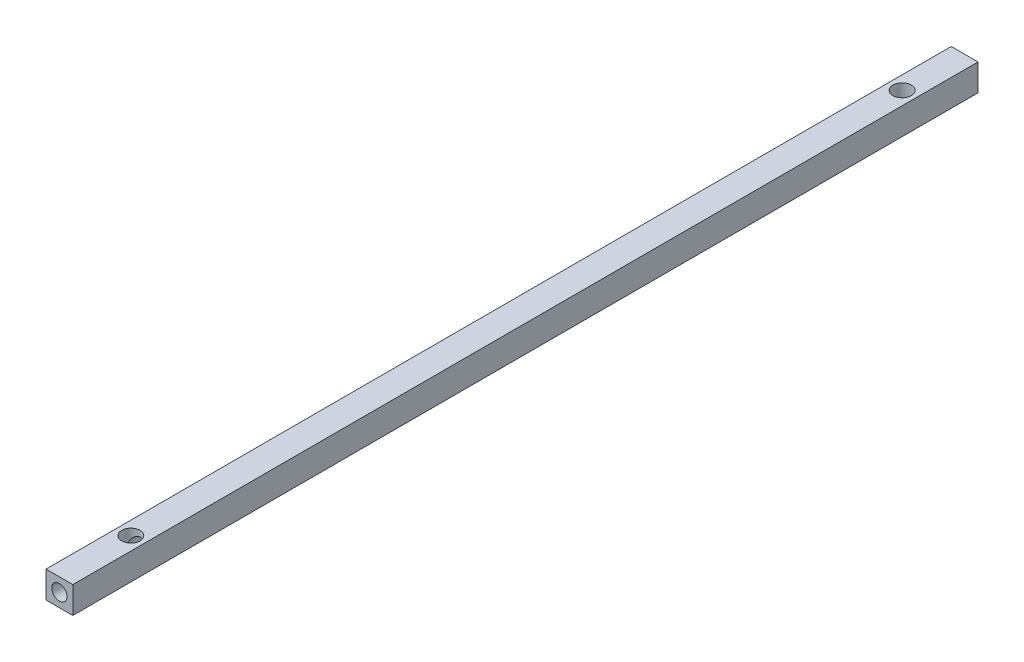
from build123d import *

# Parameters (mm, degrees)
SKETCH1_W                 = 4.7625
SKETCH1_H                 = 4.7625
EXTRUDE1_DEPTH            = 160.9725
F_6_32_TAPPED_HOLE1_D     = 2.7051
F_6_32_TAPPED_HOLE1_DEPTH = 16.764
F_6_32_TAPPED_HOLE1_TIP   = 0.81269403
F_4_CLEARANCE_HOLE1_D     = 3.2639
F_4_CLEARANCE_HOLE1_DEPTH = 10.922
F_4_CLEARANCE_HOLE1_TIP   = 0.980574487


with BuildPart() as part:
    # Sketch1 → Extrude1 (new body)
    with BuildSketch(Plane.XY):
        with Locations((2.38125, 2.38125)):
            Rectangle(SKETCH1_W, SKETCH1_H)
    extrude(amount=EXTRUDE1_DEPTH)

    # 6-32 Tapped Hole1
    with Locations(Plane.XY.offset(160.9725)):
        with Locations((2.38125, 2.38125)):
            Hole(F_6_32_TAPPED_HOLE1_D / 2, depth=F_6_32_TAPPED_HOLE1_DEPTH)
            with Locations((0, 0, -(F_6_32_TAPPED_HOLE1_DEPTH + F_6_32_TAPPED_HOLE1_TIP / 2))):  # 118° drill point
                Cone(0, F_6_32_TAPPED_HOLE1_D / 2, F_6_32_TAPPED_HOLE1_TIP, mode=Mode.SUBTRACT)

    # 4 Clearance Hole1
    with Locations(Plane(origin=(0, 4.7625, 0), x_dir=(-1, 0, 0), z_dir=(0, 1, 0))):
        with Locations((-2.38125, 148.2725), (-2.38125, 11.1125)):
            Hole(F_4_CLEARANCE_HOLE1_D / 2, depth=F_4_CLEARANCE_HOLE1_DEPTH)
            with Locations((0, 0, -(F_4_CLEARANCE_HOLE1_DEPTH + F_4_CLEARANCE_HOLE1_TIP / 2))):  # 118° drill point
                Cone(0, F_4_CLEARANCE_HOLE1_D / 2, F_4_CLEARANCE_HOLE1_TIP, mode=Mode.SUBTRACT)


solid = part.part
